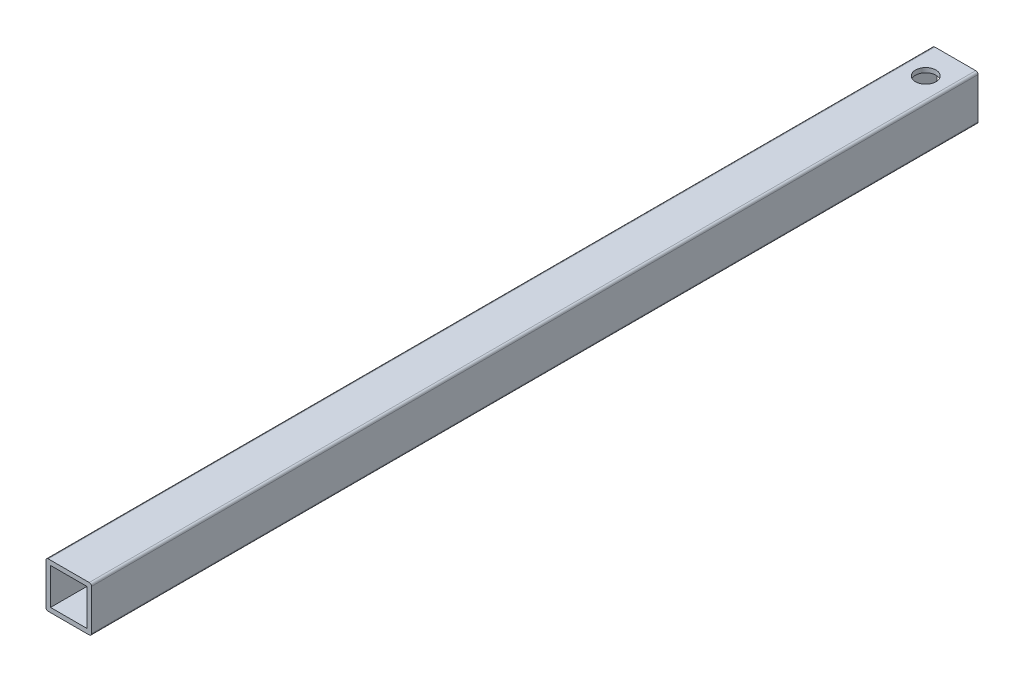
ISO-10303-21;
HEADER;
FILE_DESCRIPTION(('STEP AP214'),'2;1');
FILE_NAME('part.step','',(''),(''),'','','');
FILE_SCHEMA(('AUTOMOTIVE_DESIGN { 1 0 10303 214 1 1 1 1 }'));
ENDSEC;
DATA;
#1=APPLICATION_CONTEXT('core data for automotive mechanical design processes');
#2=APPLICATION_PROTOCOL_DEFINITION('international standard','automotive_design',2000,#1);
#3=PRODUCT_CONTEXT('',#1,'mechanical');
#4=PRODUCT('Part','Part','',(#3));
#5=PRODUCT_RELATED_PRODUCT_CATEGORY('part','',(#4));
#6=PRODUCT_DEFINITION_FORMATION('','',#4);
#7=PRODUCT_DEFINITION_CONTEXT('part definition',#1,'design');
#8=PRODUCT_DEFINITION('design','',#6,#7);
#9=PRODUCT_DEFINITION_SHAPE('','',#8);
#10=(LENGTH_UNIT() NAMED_UNIT(*) SI_UNIT(.MILLI.,.METRE.));
#11=(NAMED_UNIT(*) PLANE_ANGLE_UNIT() SI_UNIT($,.RADIAN.));
#12=(NAMED_UNIT(*) SI_UNIT($,.STERADIAN.) SOLID_ANGLE_UNIT());
#13=UNCERTAINTY_MEASURE_WITH_UNIT(LENGTH_MEASURE(1.E-05),#10,'distance_accuracy_value','');
#14=(GEOMETRIC_REPRESENTATION_CONTEXT(3) GLOBAL_UNCERTAINTY_ASSIGNED_CONTEXT((#13)) GLOBAL_UNIT_ASSIGNED_CONTEXT((#10,
#11,#12)) REPRESENTATION_CONTEXT('',''));
#15=CARTESIAN_POINT('',(0.,0.,0.));
#16=DIRECTION('',(0.,0.,1.));
#17=DIRECTION('',(1.,0.,0.));
#18=AXIS2_PLACEMENT_3D('',#15,#16,#17);
#19=CARTESIAN_POINT('',(-9.,-9.,0.));
#20=DIRECTION('',(0.,0.,-1.));
#21=DIRECTION('',(-1.,0.,0.));
#22=AXIS2_PLACEMENT_3D('',#19,#20,#21);
#23=PLANE('',#22);
#24=CARTESIAN_POINT('',(-9.,-9.,0.));
#25=DIRECTION('',(0.,0.,-1.));
#26=DIRECTION('',(-1.,0.,0.));
#27=AXIS2_PLACEMENT_3D('',#24,#25,#26);
#28=CIRCLE('',#27,0.999999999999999);
#29=CARTESIAN_POINT('',(-9.,-10.,0.));
#30=VERTEX_POINT('',#29);
#31=CARTESIAN_POINT('',(-10.,-9.,0.));
#32=VERTEX_POINT('',#31);
#33=EDGE_CURVE('E127',#30,#32,#28,.T.);
#34=ORIENTED_EDGE('',*,*,#33,.T.);
#35=DIRECTION('',(0.,-1.,0.));
#36=VECTOR('',#35,1.);
#37=CARTESIAN_POINT('',(-10.,9.,0.));
#38=LINE('',#37,#36);
#39=CARTESIAN_POINT('',(-10.,9.,0.));
#40=VERTEX_POINT('',#39);
#41=EDGE_CURVE('E162',#40,#32,#38,.T.);
#42=ORIENTED_EDGE('',*,*,#41,.F.);
#43=CARTESIAN_POINT('',(-9.,9.,0.));
#44=DIRECTION('',(0.,0.,-1.));
#45=DIRECTION('',(-1.,0.,0.));
#46=AXIS2_PLACEMENT_3D('',#43,#44,#45);
#47=CIRCLE('',#46,0.999999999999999);
#48=CARTESIAN_POINT('',(-9.,10.,0.));
#49=VERTEX_POINT('',#48);
#50=EDGE_CURVE('E165',#40,#49,#47,.T.);
#51=ORIENTED_EDGE('',*,*,#50,.T.);
#52=DIRECTION('',(1.,0.,0.));
#53=VECTOR('',#52,1.);
#54=CARTESIAN_POINT('',(-9.,10.,0.));
#55=LINE('',#54,#53);
#56=CARTESIAN_POINT('',(9.,10.,0.));
#57=VERTEX_POINT('',#56);
#58=EDGE_CURVE('E168',#49,#57,#55,.T.);
#59=ORIENTED_EDGE('',*,*,#58,.T.);
#60=CARTESIAN_POINT('',(9.,9.,0.));
#61=DIRECTION('',(0.,0.,1.));
#62=DIRECTION('',(1.,0.,0.));
#63=AXIS2_PLACEMENT_3D('',#60,#61,#62);
#64=CIRCLE('',#63,0.999999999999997);
#65=CARTESIAN_POINT('',(10.,9.00000000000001,0.));
#66=VERTEX_POINT('',#65);
#67=EDGE_CURVE('E171',#66,#57,#64,.T.);
#68=ORIENTED_EDGE('',*,*,#67,.F.);
#69=DIRECTION('',(0.,1.,0.));
#70=VECTOR('',#69,1.);
#71=CARTESIAN_POINT('',(10.,-9.,0.));
#72=LINE('',#71,#70);
#73=CARTESIAN_POINT('',(10.,-9.,0.));
#74=VERTEX_POINT('',#73);
#75=EDGE_CURVE('E174',#74,#66,#72,.T.);
#76=ORIENTED_EDGE('',*,*,#75,.F.);
#77=CARTESIAN_POINT('',(9.,-9.,0.));
#78=DIRECTION('',(0.,0.,-1.));
#79=DIRECTION('',(-1.,0.,0.));
#80=AXIS2_PLACEMENT_3D('',#77,#78,#79);
#81=CIRCLE('',#80,1.);
#82=CARTESIAN_POINT('',(9.,-10.,0.));
#83=VERTEX_POINT('',#82);
#84=EDGE_CURVE('E176',#74,#83,#81,.T.);
#85=ORIENTED_EDGE('',*,*,#84,.T.);
#86=DIRECTION('',(-1.,0.,0.));
#87=VECTOR('',#86,1.);
#88=CARTESIAN_POINT('',(9.,-10.,0.));
#89=LINE('',#88,#87);
#90=EDGE_CURVE('E179',#83,#30,#89,.T.);
#91=ORIENTED_EDGE('',*,*,#90,.T.);
#92=EDGE_LOOP('',(#34,#42,#51,#59,#68,#76,#85,#91));
#93=FACE_BOUND('',#92,.T.);
#94=DIRECTION('',(1.,0.,0.));
#95=VECTOR('',#94,1.);
#96=CARTESIAN_POINT('',(-9.,8.,0.));
#97=LINE('',#96,#95);
#98=CARTESIAN_POINT('',(-8.,8.,0.));
#99=VERTEX_POINT('',#98);
#100=CARTESIAN_POINT('',(8.,8.,0.));
#101=VERTEX_POINT('',#100);
#102=EDGE_CURVE('E139',#99,#101,#97,.T.);
#103=ORIENTED_EDGE('',*,*,#102,.F.);
#104=DIRECTION('',(0.,-1.,0.));
#105=VECTOR('',#104,1.);
#106=CARTESIAN_POINT('',(-8.,-9.,0.));
#107=LINE('',#106,#105);
#108=CARTESIAN_POINT('',(-8.,-8.,0.));
#109=VERTEX_POINT('',#108);
#110=EDGE_CURVE('E55',#99,#109,#107,.T.);
#111=ORIENTED_EDGE('',*,*,#110,.T.);
#112=DIRECTION('',(-1.,0.,0.));
#113=VECTOR('',#112,1.);
#114=CARTESIAN_POINT('',(-9.,-8.,0.));
#115=LINE('',#114,#113);
#116=CARTESIAN_POINT('',(8.,-8.,0.));
#117=VERTEX_POINT('',#116);
#118=EDGE_CURVE('E131',#117,#109,#115,.T.);
#119=ORIENTED_EDGE('',*,*,#118,.F.);
#120=DIRECTION('',(0.,1.,0.));
#121=VECTOR('',#120,1.);
#122=CARTESIAN_POINT('',(8.,-9.,0.));
#123=LINE('',#122,#121);
#124=EDGE_CURVE('E136',#117,#101,#123,.T.);
#125=ORIENTED_EDGE('',*,*,#124,.T.);
#126=EDGE_LOOP('',(#103,#111,#119,#125));
#127=FACE_BOUND('',#126,.T.);
#128=ADVANCED_FACE('F30',(#93,#127),#23,.T.);
#129=CARTESIAN_POINT('',(-9.,-9.,390.));
#130=DIRECTION('',(0.,0.,-1.));
#131=DIRECTION('',(-1.,0.,0.));
#132=AXIS2_PLACEMENT_3D('',#129,#130,#131);
#133=CYLINDRICAL_SURFACE('',#132,0.999999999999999);
#134=ORIENTED_EDGE('',*,*,#33,.F.);
#135=DIRECTION('',(0.,0.,-1.));
#136=VECTOR('',#135,1.);
#137=CARTESIAN_POINT('',(-9.,-10.,390.));
#138=LINE('',#137,#136);
#139=CARTESIAN_POINT('',(-9.,-10.,390.));
#140=VERTEX_POINT('',#139);
#141=EDGE_CURVE('E11',#140,#30,#138,.T.);
#142=ORIENTED_EDGE('',*,*,#141,.F.);
#143=CARTESIAN_POINT('',(-9.,-9.,390.));
#144=DIRECTION('',(0.,0.,-1.));
#145=DIRECTION('',(-1.,0.,0.));
#146=AXIS2_PLACEMENT_3D('',#143,#144,#145);
#147=CIRCLE('',#146,0.999999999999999);
#148=CARTESIAN_POINT('',(-10.,-9.,390.));
#149=VERTEX_POINT('',#148);
#150=EDGE_CURVE('E182',#140,#149,#147,.T.);
#151=ORIENTED_EDGE('',*,*,#150,.T.);
#152=DIRECTION('',(0.,0.,-1.));
#153=VECTOR('',#152,1.);
#154=CARTESIAN_POINT('',(-10.,-9.,390.));
#155=LINE('',#154,#153);
#156=EDGE_CURVE('E202',#149,#32,#155,.T.);
#157=ORIENTED_EDGE('',*,*,#156,.T.);
#158=EDGE_LOOP('',(#134,#142,#151,#157));
#159=FACE_BOUND('',#158,.T.);
#160=ADVANCED_FACE('F32',(#159),#133,.T.);
#161=CARTESIAN_POINT('',(9.,-10.,390.));
#162=DIRECTION('',(0.,-1.,0.));
#163=DIRECTION('',(0.,0.,-1.));
#164=AXIS2_PLACEMENT_3D('',#161,#162,#163);
#165=PLANE('',#164);
#166=CARTESIAN_POINT('',(0.,-10.,13.));
#167=DIRECTION('',(0.,1.,0.));
#168=DIRECTION('',(0.,0.,1.));
#169=AXIS2_PLACEMENT_3D('',#166,#167,#168);
#170=CIRCLE('',#169,4.5);
#171=CARTESIAN_POINT('',(0.,-10.,17.5));
#172=VERTEX_POINT('',#171);
#173=EDGE_CURVE('E304',#172,#172,#170,.T.);
#174=ORIENTED_EDGE('',*,*,#173,.T.);
#175=EDGE_LOOP('',(#174));
#176=FACE_BOUND('',#175,.T.);
#177=ORIENTED_EDGE('',*,*,#90,.F.);
#178=DIRECTION('',(0.,0.,-1.));
#179=VECTOR('',#178,1.);
#180=CARTESIAN_POINT('',(9.,-10.,390.));
#181=LINE('',#180,#179);
#182=CARTESIAN_POINT('',(9.,-10.,390.));
#183=VERTEX_POINT('',#182);
#184=EDGE_CURVE('E39',#183,#83,#181,.T.);
#185=ORIENTED_EDGE('',*,*,#184,.F.);
#186=DIRECTION('',(-1.,0.,0.));
#187=VECTOR('',#186,1.);
#188=CARTESIAN_POINT('',(9.,-10.,390.));
#189=LINE('',#188,#187);
#190=EDGE_CURVE('E200',#183,#140,#189,.T.);
#191=ORIENTED_EDGE('',*,*,#190,.T.);
#192=ORIENTED_EDGE('',*,*,#141,.T.);
#193=EDGE_LOOP('',(#177,#185,#191,#192));
#194=FACE_BOUND('',#193,.T.);
#195=ADVANCED_FACE('F229',(#176,#194),#165,.T.);
#196=CARTESIAN_POINT('',(9.,-9.,390.));
#197=DIRECTION('',(0.,0.,-1.));
#198=DIRECTION('',(-1.,0.,0.));
#199=AXIS2_PLACEMENT_3D('',#196,#197,#198);
#200=CYLINDRICAL_SURFACE('',#199,1.);
#201=ORIENTED_EDGE('',*,*,#84,.F.);
#202=DIRECTION('',(0.,0.,-1.));
#203=VECTOR('',#202,1.);
#204=CARTESIAN_POINT('',(10.,-9.,390.));
#205=LINE('',#204,#203);
#206=CARTESIAN_POINT('',(10.,-9.,390.));
#207=VERTEX_POINT('',#206);
#208=EDGE_CURVE('E205',#207,#74,#205,.T.);
#209=ORIENTED_EDGE('',*,*,#208,.F.);
#210=CARTESIAN_POINT('',(9.,-9.,390.));
#211=DIRECTION('',(0.,0.,-1.));
#212=DIRECTION('',(-1.,0.,0.));
#213=AXIS2_PLACEMENT_3D('',#210,#211,#212);
#214=CIRCLE('',#213,1.);
#215=EDGE_CURVE('E197',#207,#183,#214,.T.);
#216=ORIENTED_EDGE('',*,*,#215,.T.);
#217=ORIENTED_EDGE('',*,*,#184,.T.);
#218=EDGE_LOOP('',(#201,#209,#216,#217));
#219=FACE_BOUND('',#218,.T.);
#220=ADVANCED_FACE('F251',(#219),#200,.T.);
#221=CARTESIAN_POINT('',(10.,-9.,390.));
#222=DIRECTION('',(-1.,0.,0.));
#223=DIRECTION('',(0.,-1.,0.));
#224=AXIS2_PLACEMENT_3D('',#221,#222,#223);
#225=PLANE('',#224);
#226=ORIENTED_EDGE('',*,*,#75,.T.);
#227=DIRECTION('',(0.,0.,-1.));
#228=VECTOR('',#227,1.);
#229=CARTESIAN_POINT('',(10.,9.00000000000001,390.));
#230=LINE('',#229,#228);
#231=CARTESIAN_POINT('',(10.,9.00000000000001,390.));
#232=VERTEX_POINT('',#231);
#233=EDGE_CURVE('E207',#232,#66,#230,.T.);
#234=ORIENTED_EDGE('',*,*,#233,.F.);
#235=DIRECTION('',(0.,1.,0.));
#236=VECTOR('',#235,1.);
#237=CARTESIAN_POINT('',(10.,-9.,390.));
#238=LINE('',#237,#236);
#239=EDGE_CURVE('E195',#207,#232,#238,.T.);
#240=ORIENTED_EDGE('',*,*,#239,.F.);
#241=ORIENTED_EDGE('',*,*,#208,.T.);
#242=EDGE_LOOP('',(#226,#234,#240,#241));
#243=FACE_BOUND('',#242,.T.);
#244=ADVANCED_FACE('F249',(#243),#225,.F.);
#245=CARTESIAN_POINT('',(9.,9.,390.));
#246=DIRECTION('',(0.,0.,-1.));
#247=DIRECTION('',(-1.,0.,0.));
#248=AXIS2_PLACEMENT_3D('',#245,#246,#247);
#249=CYLINDRICAL_SURFACE('',#248,0.999999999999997);
#250=ORIENTED_EDGE('',*,*,#67,.T.);
#251=DIRECTION('',(0.,0.,-1.));
#252=VECTOR('',#251,1.);
#253=CARTESIAN_POINT('',(9.,10.,390.));
#254=LINE('',#253,#252);
#255=CARTESIAN_POINT('',(9.,10.,390.));
#256=VERTEX_POINT('',#255);
#257=EDGE_CURVE('E210',#256,#57,#254,.T.);
#258=ORIENTED_EDGE('',*,*,#257,.F.);
#259=CARTESIAN_POINT('',(9.,9.,390.));
#260=DIRECTION('',(0.,0.,1.));
#261=DIRECTION('',(1.,0.,0.));
#262=AXIS2_PLACEMENT_3D('',#259,#260,#261);
#263=CIRCLE('',#262,0.999999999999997);
#264=EDGE_CURVE('E193',#232,#256,#263,.T.);
#265=ORIENTED_EDGE('',*,*,#264,.F.);
#266=ORIENTED_EDGE('',*,*,#233,.T.);
#267=EDGE_LOOP('',(#250,#258,#265,#266));
#268=FACE_BOUND('',#267,.T.);
#269=ADVANCED_FACE('F245',(#268),#249,.T.);
#270=CARTESIAN_POINT('',(-9.,10.,390.));
#271=DIRECTION('',(0.,1.,0.));
#272=DIRECTION('',(0.,0.,1.));
#273=AXIS2_PLACEMENT_3D('',#270,#271,#272);
#274=PLANE('',#273);
#275=CARTESIAN_POINT('',(0.,10.,13.));
#276=DIRECTION('',(0.,1.,0.));
#277=DIRECTION('',(0.,0.,1.));
#278=AXIS2_PLACEMENT_3D('',#275,#276,#277);
#279=CIRCLE('',#278,4.5);
#280=CARTESIAN_POINT('',(0.,10.,17.5));
#281=VERTEX_POINT('',#280);
#282=EDGE_CURVE('E305',#281,#281,#279,.T.);
#283=ORIENTED_EDGE('',*,*,#282,.F.);
#284=EDGE_LOOP('',(#283));
#285=FACE_BOUND('',#284,.T.);
#286=ORIENTED_EDGE('',*,*,#58,.F.);
#287=DIRECTION('',(0.,0.,-1.));
#288=VECTOR('',#287,1.);
#289=CARTESIAN_POINT('',(-9.,10.,390.));
#290=LINE('',#289,#288);
#291=CARTESIAN_POINT('',(-9.,10.,390.));
#292=VERTEX_POINT('',#291);
#293=EDGE_CURVE('E212',#292,#49,#290,.T.);
#294=ORIENTED_EDGE('',*,*,#293,.F.);
#295=DIRECTION('',(1.,0.,0.));
#296=VECTOR('',#295,1.);
#297=CARTESIAN_POINT('',(-9.,10.,390.));
#298=LINE('',#297,#296);
#299=EDGE_CURVE('E190',#292,#256,#298,.T.);
#300=ORIENTED_EDGE('',*,*,#299,.T.);
#301=ORIENTED_EDGE('',*,*,#257,.T.);
#302=EDGE_LOOP('',(#286,#294,#300,#301));
#303=FACE_BOUND('',#302,.T.);
#304=ADVANCED_FACE('F241',(#285,#303),#274,.T.);
#305=CARTESIAN_POINT('',(-9.,9.,390.));
#306=DIRECTION('',(0.,0.,-1.));
#307=DIRECTION('',(-1.,0.,0.));
#308=AXIS2_PLACEMENT_3D('',#305,#306,#307);
#309=CYLINDRICAL_SURFACE('',#308,0.999999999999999);
#310=ORIENTED_EDGE('',*,*,#50,.F.);
#311=DIRECTION('',(0.,0.,-1.));
#312=VECTOR('',#311,1.);
#313=CARTESIAN_POINT('',(-10.,9.,390.));
#314=LINE('',#313,#312);
#315=CARTESIAN_POINT('',(-10.,9.,390.));
#316=VERTEX_POINT('',#315);
#317=EDGE_CURVE('E214',#316,#40,#314,.T.);
#318=ORIENTED_EDGE('',*,*,#317,.F.);
#319=CARTESIAN_POINT('',(-9.,9.,390.));
#320=DIRECTION('',(0.,0.,-1.));
#321=DIRECTION('',(-1.,0.,0.));
#322=AXIS2_PLACEMENT_3D('',#319,#320,#321);
#323=CIRCLE('',#322,0.999999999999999);
#324=EDGE_CURVE('E187',#316,#292,#323,.T.);
#325=ORIENTED_EDGE('',*,*,#324,.T.);
#326=ORIENTED_EDGE('',*,*,#293,.T.);
#327=EDGE_LOOP('',(#310,#318,#325,#326));
#328=FACE_BOUND('',#327,.T.);
#329=ADVANCED_FACE('F237',(#328),#309,.T.);
#330=CARTESIAN_POINT('',(-10.,9.,390.));
#331=DIRECTION('',(1.,0.,0.));
#332=DIRECTION('',(0.,1.,0.));
#333=AXIS2_PLACEMENT_3D('',#330,#331,#332);
#334=PLANE('',#333);
#335=ORIENTED_EDGE('',*,*,#41,.T.);
#336=ORIENTED_EDGE('',*,*,#156,.F.);
#337=DIRECTION('',(0.,-1.,0.));
#338=VECTOR('',#337,1.);
#339=CARTESIAN_POINT('',(-10.,9.,390.));
#340=LINE('',#339,#338);
#341=EDGE_CURVE('E185',#316,#149,#340,.T.);
#342=ORIENTED_EDGE('',*,*,#341,.F.);
#343=ORIENTED_EDGE('',*,*,#317,.T.);
#344=EDGE_LOOP('',(#335,#336,#342,#343));
#345=FACE_BOUND('',#344,.T.);
#346=ADVANCED_FACE('F222',(#345),#334,.F.);
#347=CARTESIAN_POINT('',(-9.,-9.,390.));
#348=DIRECTION('',(0.,0.,-1.));
#349=DIRECTION('',(-1.,0.,0.));
#350=AXIS2_PLACEMENT_3D('',#347,#348,#349);
#351=PLANE('',#350);
#352=DIRECTION('',(0.,1.,0.));
#353=VECTOR('',#352,1.);
#354=CARTESIAN_POINT('',(8.,-9.,390.));
#355=LINE('',#354,#353);
#356=CARTESIAN_POINT('',(8.,-8.,390.));
#357=VERTEX_POINT('',#356);
#358=CARTESIAN_POINT('',(8.,8.,390.));
#359=VERTEX_POINT('',#358);
#360=EDGE_CURVE('E151',#357,#359,#355,.T.);
#361=ORIENTED_EDGE('',*,*,#360,.F.);
#362=DIRECTION('',(-1.,0.,0.));
#363=VECTOR('',#362,1.);
#364=CARTESIAN_POINT('',(-9.,-8.,390.));
#365=LINE('',#364,#363);
#366=CARTESIAN_POINT('',(-8.,-8.,390.));
#367=VERTEX_POINT('',#366);
#368=EDGE_CURVE('E149',#357,#367,#365,.T.);
#369=ORIENTED_EDGE('',*,*,#368,.T.);
#370=DIRECTION('',(0.,-1.,0.));
#371=VECTOR('',#370,1.);
#372=CARTESIAN_POINT('',(-8.,-9.,390.));
#373=LINE('',#372,#371);
#374=CARTESIAN_POINT('',(-8.,8.,390.));
#375=VERTEX_POINT('',#374);
#376=EDGE_CURVE('E123',#375,#367,#373,.T.);
#377=ORIENTED_EDGE('',*,*,#376,.F.);
#378=DIRECTION('',(1.,0.,0.));
#379=VECTOR('',#378,1.);
#380=CARTESIAN_POINT('',(-9.,8.,390.));
#381=LINE('',#380,#379);
#382=EDGE_CURVE('E153',#375,#359,#381,.T.);
#383=ORIENTED_EDGE('',*,*,#382,.T.);
#384=EDGE_LOOP('',(#361,#369,#377,#383));
#385=FACE_BOUND('',#384,.T.);
#386=ORIENTED_EDGE('',*,*,#150,.F.);
#387=ORIENTED_EDGE('',*,*,#190,.F.);
#388=ORIENTED_EDGE('',*,*,#215,.F.);
#389=ORIENTED_EDGE('',*,*,#239,.T.);
#390=ORIENTED_EDGE('',*,*,#264,.T.);
#391=ORIENTED_EDGE('',*,*,#299,.F.);
#392=ORIENTED_EDGE('',*,*,#324,.F.);
#393=ORIENTED_EDGE('',*,*,#341,.T.);
#394=EDGE_LOOP('',(#386,#387,#388,#389,#390,#391,#392,#393));
#395=FACE_BOUND('',#394,.T.);
#396=ADVANCED_FACE('F232',(#385,#395),#351,.F.);
#397=CARTESIAN_POINT('',(-8.,-9.,390.));
#398=DIRECTION('',(1.,0.,0.));
#399=DIRECTION('',(0.,1.,0.));
#400=AXIS2_PLACEMENT_3D('',#397,#398,#399);
#401=PLANE('',#400);
#402=ORIENTED_EDGE('',*,*,#110,.F.);
#403=DIRECTION('',(0.,0.,-1.));
#404=VECTOR('',#403,1.);
#405=CARTESIAN_POINT('',(-8.,8.,390.));
#406=LINE('',#405,#404);
#407=EDGE_CURVE('E156',#375,#99,#406,.T.);
#408=ORIENTED_EDGE('',*,*,#407,.F.);
#409=ORIENTED_EDGE('',*,*,#376,.T.);
#410=DIRECTION('',(0.,0.,-1.));
#411=VECTOR('',#410,1.);
#412=CARTESIAN_POINT('',(-8.,-8.,390.));
#413=LINE('',#412,#411);
#414=EDGE_CURVE('E119',#367,#109,#413,.T.);
#415=ORIENTED_EDGE('',*,*,#414,.T.);
#416=EDGE_LOOP('',(#402,#408,#409,#415));
#417=FACE_BOUND('',#416,.T.);
#418=ADVANCED_FACE('F121',(#417),#401,.T.);
#419=CARTESIAN_POINT('',(-9.,-8.,390.));
#420=DIRECTION('',(0.,-1.,0.));
#421=DIRECTION('',(0.,0.,-1.));
#422=AXIS2_PLACEMENT_3D('',#419,#420,#421);
#423=PLANE('',#422);
#424=CARTESIAN_POINT('',(0.,-8.,13.));
#425=DIRECTION('',(0.,-1.,0.));
#426=DIRECTION('',(0.,0.,-1.));
#427=AXIS2_PLACEMENT_3D('',#424,#425,#426);
#428=CIRCLE('',#427,4.5);
#429=CARTESIAN_POINT('',(0.,-8.,8.5));
#430=VERTEX_POINT('',#429);
#431=EDGE_CURVE('E140',#430,#430,#428,.T.);
#432=ORIENTED_EDGE('',*,*,#431,.T.);
#433=EDGE_LOOP('',(#432));
#434=FACE_BOUND('',#433,.T.);
#435=ORIENTED_EDGE('',*,*,#118,.T.);
#436=ORIENTED_EDGE('',*,*,#414,.F.);
#437=ORIENTED_EDGE('',*,*,#368,.F.);
#438=DIRECTION('',(0.,0.,-1.));
#439=VECTOR('',#438,1.);
#440=CARTESIAN_POINT('',(8.,-8.,390.));
#441=LINE('',#440,#439);
#442=EDGE_CURVE('E128',#357,#117,#441,.T.);
#443=ORIENTED_EDGE('',*,*,#442,.T.);
#444=EDGE_LOOP('',(#435,#436,#437,#443));
#445=FACE_BOUND('',#444,.T.);
#446=ADVANCED_FACE('F132',(#434,#445),#423,.F.);
#447=CARTESIAN_POINT('',(8.,-9.,390.));
#448=DIRECTION('',(-1.,0.,0.));
#449=DIRECTION('',(0.,-1.,0.));
#450=AXIS2_PLACEMENT_3D('',#447,#448,#449);
#451=PLANE('',#450);
#452=ORIENTED_EDGE('',*,*,#124,.F.);
#453=ORIENTED_EDGE('',*,*,#442,.F.);
#454=ORIENTED_EDGE('',*,*,#360,.T.);
#455=DIRECTION('',(0.,0.,-1.));
#456=VECTOR('',#455,1.);
#457=CARTESIAN_POINT('',(8.,8.,390.));
#458=LINE('',#457,#456);
#459=EDGE_CURVE('E47',#359,#101,#458,.T.);
#460=ORIENTED_EDGE('',*,*,#459,.T.);
#461=EDGE_LOOP('',(#452,#453,#454,#460));
#462=FACE_BOUND('',#461,.T.);
#463=ADVANCED_FACE('F277',(#462),#451,.T.);
#464=CARTESIAN_POINT('',(-9.,8.,390.));
#465=DIRECTION('',(0.,1.,0.));
#466=DIRECTION('',(0.,0.,1.));
#467=AXIS2_PLACEMENT_3D('',#464,#465,#466);
#468=PLANE('',#467);
#469=CARTESIAN_POINT('',(0.,8.,13.));
#470=DIRECTION('',(0.,1.,0.));
#471=DIRECTION('',(0.,0.,1.));
#472=AXIS2_PLACEMENT_3D('',#469,#470,#471);
#473=CIRCLE('',#472,4.5);
#474=CARTESIAN_POINT('',(0.,8.,17.5));
#475=VERTEX_POINT('',#474);
#476=EDGE_CURVE('E34',#475,#475,#473,.T.);
#477=ORIENTED_EDGE('',*,*,#476,.T.);
#478=EDGE_LOOP('',(#477));
#479=FACE_BOUND('',#478,.T.);
#480=ORIENTED_EDGE('',*,*,#102,.T.);
#481=ORIENTED_EDGE('',*,*,#459,.F.);
#482=ORIENTED_EDGE('',*,*,#382,.F.);
#483=ORIENTED_EDGE('',*,*,#407,.T.);
#484=EDGE_LOOP('',(#480,#481,#482,#483));
#485=FACE_BOUND('',#484,.T.);
#486=ADVANCED_FACE('F278',(#479,#485),#468,.F.);
#487=CARTESIAN_POINT('',(0.,-10.,13.));
#488=DIRECTION('',(0.,1.,0.));
#489=DIRECTION('',(0.,0.,1.));
#490=AXIS2_PLACEMENT_3D('',#487,#488,#489);
#491=CYLINDRICAL_SURFACE('',#490,4.5);
#492=ORIENTED_EDGE('',*,*,#282,.T.);
#493=EDGE_LOOP('',(#492));
#494=FACE_BOUND('',#493,.T.);
#495=ORIENTED_EDGE('',*,*,#476,.F.);
#496=EDGE_LOOP('',(#495));
#497=FACE_BOUND('',#496,.T.);
#498=ADVANCED_FACE('F280',(#494,#497),#491,.F.);
#499=ORIENTED_EDGE('',*,*,#173,.F.);
#500=EDGE_LOOP('',(#499));
#501=FACE_BOUND('',#500,.T.);
#502=ORIENTED_EDGE('',*,*,#431,.F.);
#503=EDGE_LOOP('',(#502));
#504=FACE_BOUND('',#503,.T.);
#505=ADVANCED_FACE('F287',(#501,#504),#491,.F.);
#506=CLOSED_SHELL('',(#128,#160,#195,#220,#244,#269,#304,#329,#346,#396,#418,#446,#463,#486,
#498,#505));
#507=MANIFOLD_SOLID_BREP('B2',#506);
#508=ADVANCED_BREP_SHAPE_REPRESENTATION('',(#18,#507),#14);
#509=SHAPE_DEFINITION_REPRESENTATION(#9,#508);
ENDSEC;
END-ISO-10303-21;
